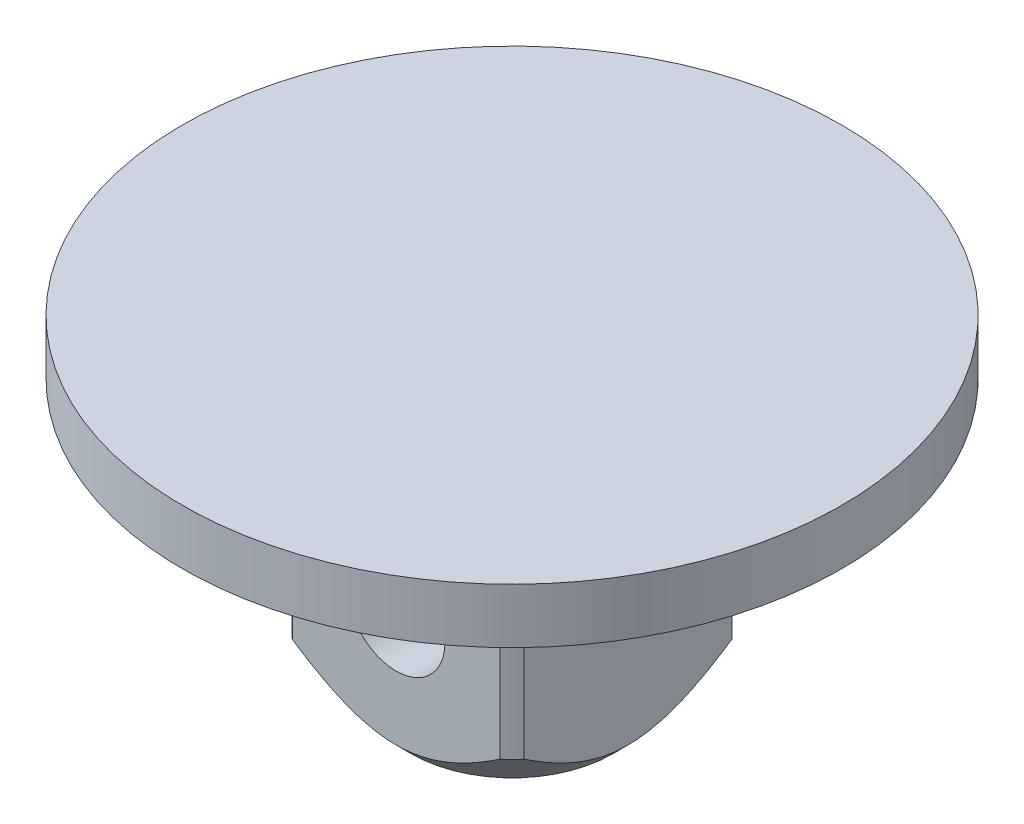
from build123d import *

# Parameters (mm, degrees)
CHANFREIN1_SIZE                   = 4.5
ESQUISSE2_OUTSIDE_W               = 72.2
ESQUISSE2_OUTSIDE_H               = 72.2
ESQUISSE2_OUTSIDE_W_2             = 19
ESQUISSE2_OUTSIDE_H_2             = 19
ENL_V_MAT_EXTRU_1_DEPTH           = 21
DIAM_TRE_DU_PER_AGE_8_0_8_1_D     = 8
DIAM_TRE_DU_PER_AGE_8_0_8_1_DEPTH = 13
DIAM_TRE_DU_PER_AGE_8_0_8_1_TIP   = 2.403442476


with BuildPart() as part:
    # Esquisse1 → R_volution1 (revolve)
    with BuildSketch(Plane.XY, mode=Mode.PRIVATE) as r_volution1_sk:
        Polygon((0, 4.5), (27, 4.5), (27, 0), (12.75, 0), (12.75, -22.5), (0, -22.5), align=None)
    revolve(r_volution1_sk.sketch.rotate(Axis((0, 0, 0), (0, 1, 0)), 90), axis=Axis((0, 0, 0), (0, 1, 0)))

    # Chanfrein1
    chanfrein1_edges = [part.edges().sort_by_distance(p)[0] for p in [
        (0, -22.5, 12.75),
    ]]
    chamfer(chanfrein1_edges, length=CHANFREIN1_SIZE)

    # Esquisse2 outside → Enl_v. mat.-Extru.1 (cut)
    with BuildSketch(Plane.XZ.offset(22.5)):
        Rectangle(ESQUISSE2_OUTSIDE_W, ESQUISSE2_OUTSIDE_H)
        Rectangle(ESQUISSE2_OUTSIDE_W_2, ESQUISSE2_OUTSIDE_H_2, mode=Mode.SUBTRACT)
    extrude(amount=-ENL_V_MAT_EXTRU_1_DEPTH, mode=Mode.SUBTRACT)

    # Diam_tre du per_age _8.0 _8_1
    with Locations(Plane.XY.offset(9.5)):
        with Locations((0, -12)):
            Hole(DIAM_TRE_DU_PER_AGE_8_0_8_1_D / 2, depth=DIAM_TRE_DU_PER_AGE_8_0_8_1_DEPTH)
            with Locations((0, 0, -(DIAM_TRE_DU_PER_AGE_8_0_8_1_DEPTH + DIAM_TRE_DU_PER_AGE_8_0_8_1_TIP / 2))):  # 118° drill point
                Cone(0, DIAM_TRE_DU_PER_AGE_8_0_8_1_D / 2, DIAM_TRE_DU_PER_AGE_8_0_8_1_TIP, mode=Mode.SUBTRACT)


solid = part.part
